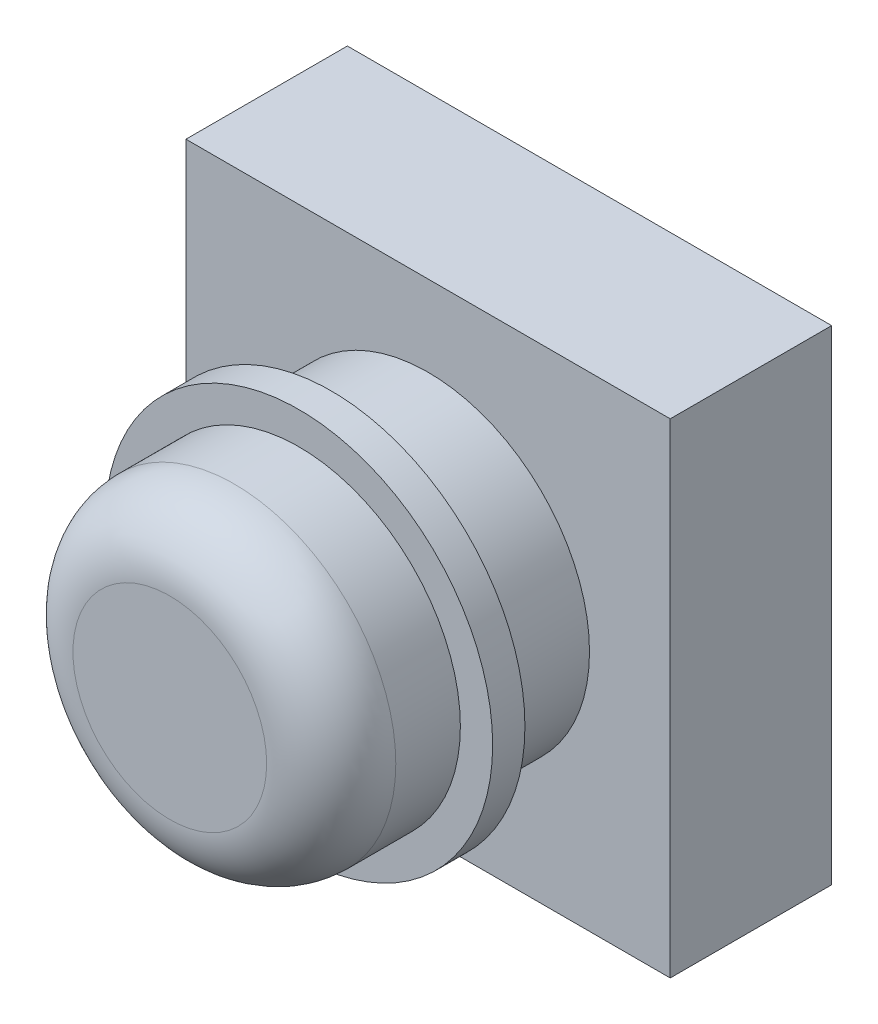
ISO-10303-21;
HEADER;
FILE_DESCRIPTION(('STEP AP214'),'2;1');
FILE_NAME('part.step','',(''),(''),'','','');
FILE_SCHEMA(('AUTOMOTIVE_DESIGN { 1 0 10303 214 1 1 1 1 }'));
ENDSEC;
DATA;
#1=APPLICATION_CONTEXT('core data for automotive mechanical design processes');
#2=APPLICATION_PROTOCOL_DEFINITION('international standard','automotive_design',2000,#1);
#3=PRODUCT_CONTEXT('',#1,'mechanical');
#4=PRODUCT('Part','Part','',(#3));
#5=PRODUCT_RELATED_PRODUCT_CATEGORY('part','',(#4));
#6=PRODUCT_DEFINITION_FORMATION('','',#4);
#7=PRODUCT_DEFINITION_CONTEXT('part definition',#1,'design');
#8=PRODUCT_DEFINITION('design','',#6,#7);
#9=PRODUCT_DEFINITION_SHAPE('','',#8);
#10=(LENGTH_UNIT() NAMED_UNIT(*) SI_UNIT(.MILLI.,.METRE.));
#11=(NAMED_UNIT(*) PLANE_ANGLE_UNIT() SI_UNIT($,.RADIAN.));
#12=(NAMED_UNIT(*) SI_UNIT($,.STERADIAN.) SOLID_ANGLE_UNIT());
#13=UNCERTAINTY_MEASURE_WITH_UNIT(LENGTH_MEASURE(1.E-05),#10,'distance_accuracy_value','');
#14=(GEOMETRIC_REPRESENTATION_CONTEXT(3) GLOBAL_UNCERTAINTY_ASSIGNED_CONTEXT((#13)) GLOBAL_UNIT_ASSIGNED_CONTEXT((#10,
#11,#12)) REPRESENTATION_CONTEXT('',''));
#15=CARTESIAN_POINT('',(0.,0.,0.));
#16=DIRECTION('',(0.,0.,1.));
#17=DIRECTION('',(1.,0.,0.));
#18=AXIS2_PLACEMENT_3D('',#15,#16,#17);
#19=CARTESIAN_POINT('',(0.,0.,13.));
#20=DIRECTION('',(0.,0.,-1.));
#21=DIRECTION('',(-1.,0.,0.));
#22=AXIS2_PLACEMENT_3D('',#19,#20,#21);
#23=CYLINDRICAL_SURFACE('',#22,5.);
#24=CARTESIAN_POINT('',(0.,0.,5.));
#25=DIRECTION('',(0.,0.,1.));
#26=DIRECTION('',(1.,0.,0.));
#27=AXIS2_PLACEMENT_3D('',#24,#25,#26);
#28=CIRCLE('',#27,5.);
#29=CARTESIAN_POINT('',(5.,0.,5.));
#30=VERTEX_POINT('',#29);
#31=EDGE_CURVE('E81',#30,#30,#28,.T.);
#32=ORIENTED_EDGE('',*,*,#31,.T.);
#33=EDGE_LOOP('',(#32));
#34=FACE_BOUND('',#33,.T.);
#35=CARTESIAN_POINT('',(0.,0.,8.));
#36=DIRECTION('',(0.,0.,1.));
#37=DIRECTION('',(1.,0.,0.));
#38=AXIS2_PLACEMENT_3D('',#35,#36,#37);
#39=CIRCLE('',#38,5.);
#40=CARTESIAN_POINT('',(5.,0.,8.));
#41=VERTEX_POINT('',#40);
#42=EDGE_CURVE('E11',#41,#41,#39,.T.);
#43=ORIENTED_EDGE('',*,*,#42,.F.);
#44=EDGE_LOOP('',(#43));
#45=FACE_BOUND('',#44,.T.);
#46=ADVANCED_FACE('F29',(#34,#45),#23,.T.);
#47=CARTESIAN_POINT('',(-7.5,-7.5,5.));
#48=DIRECTION('',(0.,0.,-1.));
#49=DIRECTION('',(-1.,0.,0.));
#50=AXIS2_PLACEMENT_3D('',#47,#48,#49);
#51=PLANE('',#50);
#52=DIRECTION('',(0.,-1.,0.));
#53=VECTOR('',#52,1.);
#54=CARTESIAN_POINT('',(-7.5,7.5,5.));
#55=LINE('',#54,#53);
#56=CARTESIAN_POINT('',(-7.5,7.5,5.));
#57=VERTEX_POINT('',#56);
#58=CARTESIAN_POINT('',(-7.5,-7.5,5.));
#59=VERTEX_POINT('',#58);
#60=EDGE_CURVE('E99',#57,#59,#55,.T.);
#61=ORIENTED_EDGE('',*,*,#60,.T.);
#62=DIRECTION('',(-1.,0.,0.));
#63=VECTOR('',#62,1.);
#64=CARTESIAN_POINT('',(7.5,-7.5,5.));
#65=LINE('',#64,#63);
#66=CARTESIAN_POINT('',(7.5,-7.5,5.));
#67=VERTEX_POINT('',#66);
#68=EDGE_CURVE('E78',#67,#59,#65,.T.);
#69=ORIENTED_EDGE('',*,*,#68,.F.);
#70=DIRECTION('',(0.,1.,0.));
#71=VECTOR('',#70,1.);
#72=CARTESIAN_POINT('',(7.5,-7.5,5.));
#73=LINE('',#72,#71);
#74=CARTESIAN_POINT('',(7.5,7.5,5.));
#75=VERTEX_POINT('',#74);
#76=EDGE_CURVE('E102',#67,#75,#73,.T.);
#77=ORIENTED_EDGE('',*,*,#76,.T.);
#78=DIRECTION('',(1.,0.,0.));
#79=VECTOR('',#78,1.);
#80=CARTESIAN_POINT('',(-7.5,7.5,5.));
#81=LINE('',#80,#79);
#82=EDGE_CURVE('E104',#57,#75,#81,.T.);
#83=ORIENTED_EDGE('',*,*,#82,.F.);
#84=EDGE_LOOP('',(#61,#69,#77,#83));
#85=FACE_BOUND('',#84,.T.);
#86=ORIENTED_EDGE('',*,*,#31,.F.);
#87=EDGE_LOOP('',(#86));
#88=FACE_BOUND('',#87,.T.);
#89=ADVANCED_FACE('F134',(#85,#88),#51,.F.);
#90=CARTESIAN_POINT('',(-7.5,7.5,5.));
#91=DIRECTION('',(1.,0.,0.));
#92=DIRECTION('',(0.,1.,0.));
#93=AXIS2_PLACEMENT_3D('',#90,#91,#92);
#94=PLANE('',#93);
#95=DIRECTION('',(0.,0.,-1.));
#96=VECTOR('',#95,1.);
#97=CARTESIAN_POINT('',(-7.5,-7.5,5.));
#98=LINE('',#97,#96);
#99=CARTESIAN_POINT('',(-7.5,-7.5,0.));
#100=VERTEX_POINT('',#99);
#101=EDGE_CURVE('E72',#59,#100,#98,.T.);
#102=ORIENTED_EDGE('',*,*,#101,.F.);
#103=ORIENTED_EDGE('',*,*,#60,.F.);
#104=DIRECTION('',(0.,0.,-1.));
#105=VECTOR('',#104,1.);
#106=CARTESIAN_POINT('',(-7.5,7.5,5.));
#107=LINE('',#106,#105);
#108=CARTESIAN_POINT('',(-7.5,7.5,0.));
#109=VERTEX_POINT('',#108);
#110=EDGE_CURVE('E44',#57,#109,#107,.T.);
#111=ORIENTED_EDGE('',*,*,#110,.T.);
#112=DIRECTION('',(0.,-1.,0.));
#113=VECTOR('',#112,1.);
#114=CARTESIAN_POINT('',(-7.5,7.5,0.));
#115=LINE('',#114,#113);
#116=EDGE_CURVE('E85',#109,#100,#115,.T.);
#117=ORIENTED_EDGE('',*,*,#116,.T.);
#118=EDGE_LOOP('',(#102,#103,#111,#117));
#119=FACE_BOUND('',#118,.T.);
#120=ADVANCED_FACE('F86',(#119),#94,.F.);
#121=CARTESIAN_POINT('',(7.5,-7.5,5.));
#122=DIRECTION('',(0.,-1.,0.));
#123=DIRECTION('',(1.,0.,0.));
#124=AXIS2_PLACEMENT_3D('',#121,#122,#123);
#125=PLANE('',#124);
#126=DIRECTION('',(0.,0.,-1.));
#127=VECTOR('',#126,1.);
#128=CARTESIAN_POINT('',(7.5,-7.5,5.));
#129=LINE('',#128,#127);
#130=CARTESIAN_POINT('',(7.5,-7.5,0.));
#131=VERTEX_POINT('',#130);
#132=EDGE_CURVE('E82',#67,#131,#129,.T.);
#133=ORIENTED_EDGE('',*,*,#132,.F.);
#134=ORIENTED_EDGE('',*,*,#68,.T.);
#135=ORIENTED_EDGE('',*,*,#101,.T.);
#136=DIRECTION('',(-1.,0.,0.));
#137=VECTOR('',#136,1.);
#138=CARTESIAN_POINT('',(7.5,-7.5,0.));
#139=LINE('',#138,#137);
#140=EDGE_CURVE('E75',#131,#100,#139,.T.);
#141=ORIENTED_EDGE('',*,*,#140,.F.);
#142=EDGE_LOOP('',(#133,#134,#135,#141));
#143=FACE_BOUND('',#142,.T.);
#144=ADVANCED_FACE('F31',(#143),#125,.T.);
#145=CARTESIAN_POINT('',(7.5,-7.5,5.));
#146=DIRECTION('',(-1.,0.,0.));
#147=DIRECTION('',(0.,0.,1.));
#148=AXIS2_PLACEMENT_3D('',#145,#146,#147);
#149=PLANE('',#148);
#150=DIRECTION('',(0.,0.,-1.));
#151=VECTOR('',#150,1.);
#152=CARTESIAN_POINT('',(7.5,7.5,5.));
#153=LINE('',#152,#151);
#154=CARTESIAN_POINT('',(7.5,7.5,0.));
#155=VERTEX_POINT('',#154);
#156=EDGE_CURVE('E52',#75,#155,#153,.T.);
#157=ORIENTED_EDGE('',*,*,#156,.F.);
#158=ORIENTED_EDGE('',*,*,#76,.F.);
#159=ORIENTED_EDGE('',*,*,#132,.T.);
#160=DIRECTION('',(0.,1.,0.));
#161=VECTOR('',#160,1.);
#162=CARTESIAN_POINT('',(7.5,-7.5,0.));
#163=LINE('',#162,#161);
#164=EDGE_CURVE('E92',#131,#155,#163,.T.);
#165=ORIENTED_EDGE('',*,*,#164,.T.);
#166=EDGE_LOOP('',(#157,#158,#159,#165));
#167=FACE_BOUND('',#166,.T.);
#168=ADVANCED_FACE('F181',(#167),#149,.F.);
#169=CARTESIAN_POINT('',(-7.5,7.5,5.));
#170=DIRECTION('',(0.,1.,0.));
#171=DIRECTION('',(0.,0.,1.));
#172=AXIS2_PLACEMENT_3D('',#169,#170,#171);
#173=PLANE('',#172);
#174=ORIENTED_EDGE('',*,*,#82,.T.);
#175=ORIENTED_EDGE('',*,*,#156,.T.);
#176=DIRECTION('',(1.,0.,0.));
#177=VECTOR('',#176,1.);
#178=CARTESIAN_POINT('',(-7.5,7.5,0.));
#179=LINE('',#178,#177);
#180=EDGE_CURVE('E94',#109,#155,#179,.T.);
#181=ORIENTED_EDGE('',*,*,#180,.F.);
#182=ORIENTED_EDGE('',*,*,#110,.F.);
#183=EDGE_LOOP('',(#174,#175,#181,#182));
#184=FACE_BOUND('',#183,.T.);
#185=ADVANCED_FACE('F177',(#184),#173,.T.);
#186=CARTESIAN_POINT('',(-7.5,-7.5,0.));
#187=DIRECTION('',(0.,0.,-1.));
#188=DIRECTION('',(-1.,0.,0.));
#189=AXIS2_PLACEMENT_3D('',#186,#187,#188);
#190=PLANE('',#189);
#191=ORIENTED_EDGE('',*,*,#116,.F.);
#192=ORIENTED_EDGE('',*,*,#180,.T.);
#193=ORIENTED_EDGE('',*,*,#164,.F.);
#194=ORIENTED_EDGE('',*,*,#140,.T.);
#195=EDGE_LOOP('',(#191,#192,#193,#194));
#196=FACE_BOUND('',#195,.T.);
#197=ADVANCED_FACE('F91',(#196),#190,.T.);
#198=CARTESIAN_POINT('',(0.,0.,9.));
#199=DIRECTION('',(0.,0.,1.));
#200=DIRECTION('',(1.,0.,0.));
#201=AXIS2_PLACEMENT_3D('',#198,#199,#200);
#202=PLANE('',#201);
#203=CARTESIAN_POINT('',(0.,0.,9.));
#204=DIRECTION('',(0.,0.,1.));
#205=DIRECTION('',(1.,0.,0.));
#206=AXIS2_PLACEMENT_3D('',#203,#204,#205);
#207=CIRCLE('',#206,6.);
#208=CARTESIAN_POINT('',(6.,0.,9.));
#209=VERTEX_POINT('',#208);
#210=EDGE_CURVE('E89',#209,#209,#207,.T.);
#211=ORIENTED_EDGE('',*,*,#210,.T.);
#212=EDGE_LOOP('',(#211));
#213=FACE_BOUND('',#212,.T.);
#214=CARTESIAN_POINT('',(0.,0.,9.));
#215=DIRECTION('',(0.,0.,1.));
#216=DIRECTION('',(1.,0.,0.));
#217=AXIS2_PLACEMENT_3D('',#214,#215,#216);
#218=CIRCLE('',#217,5.);
#219=CARTESIAN_POINT('',(5.,0.,9.));
#220=VERTEX_POINT('',#219);
#221=EDGE_CURVE('E150',#220,#220,#218,.T.);
#222=ORIENTED_EDGE('',*,*,#221,.F.);
#223=EDGE_LOOP('',(#222));
#224=FACE_BOUND('',#223,.T.);
#225=ADVANCED_FACE('F162',(#213,#224),#202,.T.);
#226=CARTESIAN_POINT('',(0.,0.,8.));
#227=DIRECTION('',(0.,0.,1.));
#228=DIRECTION('',(1.,0.,0.));
#229=AXIS2_PLACEMENT_3D('',#226,#227,#228);
#230=PLANE('',#229);
#231=CARTESIAN_POINT('',(0.,0.,8.));
#232=DIRECTION('',(0.,0.,1.));
#233=DIRECTION('',(1.,0.,0.));
#234=AXIS2_PLACEMENT_3D('',#231,#232,#233);
#235=CIRCLE('',#234,6.);
#236=CARTESIAN_POINT('',(6.,0.,8.));
#237=VERTEX_POINT('',#236);
#238=EDGE_CURVE('E152',#237,#237,#235,.T.);
#239=ORIENTED_EDGE('',*,*,#238,.F.);
#240=EDGE_LOOP('',(#239));
#241=FACE_BOUND('',#240,.T.);
#242=ORIENTED_EDGE('',*,*,#42,.T.);
#243=EDGE_LOOP('',(#242));
#244=FACE_BOUND('',#243,.T.);
#245=ADVANCED_FACE('F129',(#241,#244),#230,.F.);
#246=CARTESIAN_POINT('',(0.,0.,9.));
#247=DIRECTION('',(0.,0.,-1.));
#248=DIRECTION('',(-1.,0.,0.));
#249=AXIS2_PLACEMENT_3D('',#246,#247,#248);
#250=CYLINDRICAL_SURFACE('',#249,6.);
#251=ORIENTED_EDGE('',*,*,#210,.F.);
#252=EDGE_LOOP('',(#251));
#253=FACE_BOUND('',#252,.T.);
#254=ORIENTED_EDGE('',*,*,#238,.T.);
#255=EDGE_LOOP('',(#254));
#256=FACE_BOUND('',#255,.T.);
#257=ADVANCED_FACE('F124',(#253,#256),#250,.T.);
#258=CARTESIAN_POINT('',(0.,0.,13.));
#259=DIRECTION('',(0.,0.,1.));
#260=DIRECTION('',(1.,0.,0.));
#261=AXIS2_PLACEMENT_3D('',#258,#259,#260);
#262=PLANE('',#261);
#263=CARTESIAN_POINT('',(0.,0.,13.));
#264=DIRECTION('',(0.,0.,1.));
#265=DIRECTION('',(1.,0.,0.));
#266=AXIS2_PLACEMENT_3D('',#263,#264,#265);
#267=CIRCLE('',#266,3.);
#268=CARTESIAN_POINT('',(3.,0.,13.));
#269=VERTEX_POINT('',#268);
#270=EDGE_CURVE('E109',#269,#269,#267,.T.);
#271=ORIENTED_EDGE('',*,*,#270,.T.);
#272=EDGE_LOOP('',(#271));
#273=FACE_BOUND('',#272,.T.);
#274=ADVANCED_FACE('F119',(#273),#262,.T.);
#275=CARTESIAN_POINT('',(0.,0.,11.));
#276=DIRECTION('',(0.,0.,1.));
#277=DIRECTION('',(1.,0.,0.));
#278=AXIS2_PLACEMENT_3D('',#275,#276,#277);
#279=TOROIDAL_SURFACE('',#278,3.,2.);
#280=CARTESIAN_POINT('',(0.,0.,11.));
#281=DIRECTION('',(0.,0.,1.));
#282=DIRECTION('',(1.,0.,0.));
#283=AXIS2_PLACEMENT_3D('',#280,#281,#282);
#284=CIRCLE('',#283,5.);
#285=CARTESIAN_POINT('',(5.,0.,11.));
#286=VERTEX_POINT('',#285);
#287=EDGE_CURVE('E37',#286,#286,#284,.F.);
#288=ORIENTED_EDGE('',*,*,#287,.F.);
#289=EDGE_LOOP('',(#288));
#290=FACE_BOUND('',#289,.T.);
#291=ORIENTED_EDGE('',*,*,#270,.F.);
#292=EDGE_LOOP('',(#291));
#293=FACE_BOUND('',#292,.T.);
#294=ADVANCED_FACE('F116',(#290,#293),#279,.T.);
#295=ORIENTED_EDGE('',*,*,#221,.T.);
#296=EDGE_LOOP('',(#295));
#297=FACE_BOUND('',#296,.T.);
#298=ORIENTED_EDGE('',*,*,#287,.T.);
#299=EDGE_LOOP('',(#298));
#300=FACE_BOUND('',#299,.T.);
#301=ADVANCED_FACE('F114',(#297,#300),#23,.T.);
#302=CLOSED_SHELL('',(#46,#89,#120,#144,#168,#185,#197,#225,#245,#257,#274,#294,#301));
#303=MANIFOLD_SOLID_BREP('B2',#302);
#304=ADVANCED_BREP_SHAPE_REPRESENTATION('',(#18,#303),#14);
#305=SHAPE_DEFINITION_REPRESENTATION(#9,#304);
ENDSEC;
END-ISO-10303-21;
